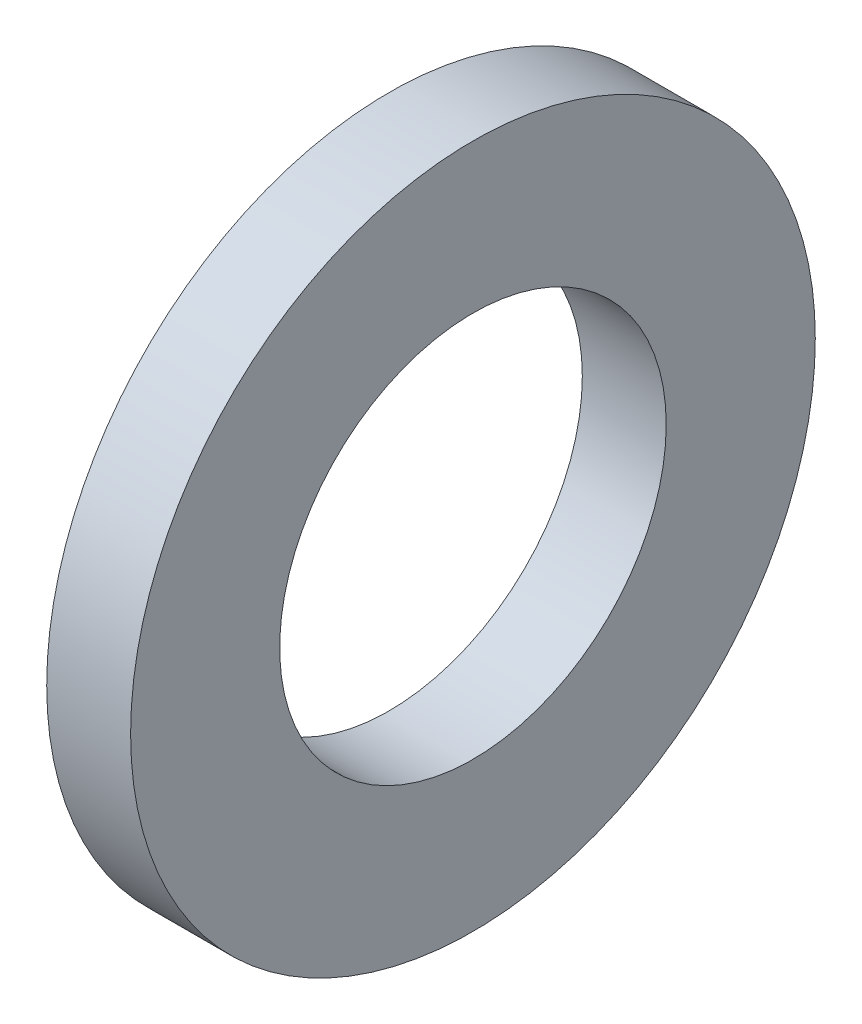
from build123d import *

# Parameters (mm, degrees)
SKETCH1_R           = 5.8039
SKETCH1_R_2         = 3.2766
BOSS_EXTRUDE1_DEPTH = 1.4224


with BuildPart() as part:
    # Sketch1 → Boss-Extrude1 (new body)
    with BuildSketch(Plane(origin=(0, 0, 0), x_dir=(0, 0, -1), z_dir=(1, 0, 0))):
        Circle(SKETCH1_R)
        Circle(SKETCH1_R_2, mode=Mode.SUBTRACT)
    extrude(amount=BOSS_EXTRUDE1_DEPTH)


solid = part.part
